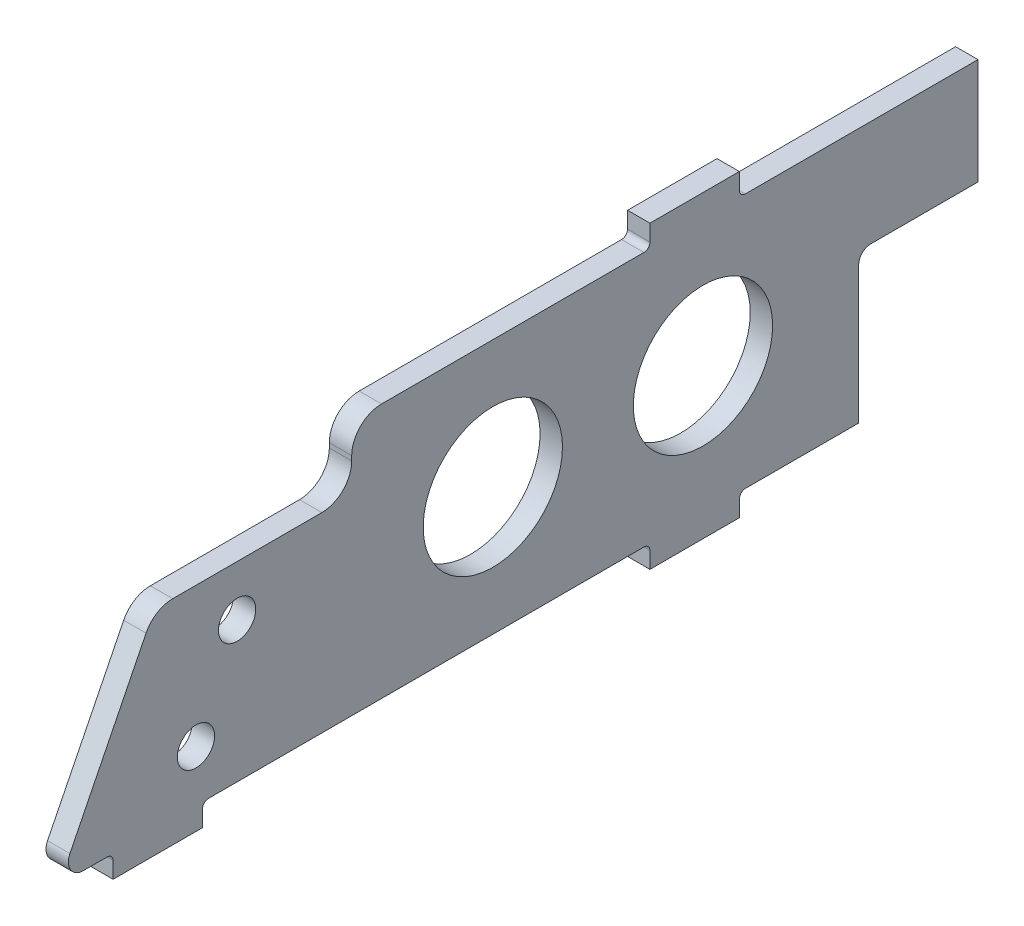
ISO-10303-21;
HEADER;
FILE_DESCRIPTION(('STEP AP214'),'2;1');
FILE_NAME('part.step','',(''),(''),'','','');
FILE_SCHEMA(('AUTOMOTIVE_DESIGN { 1 0 10303 214 1 1 1 1 }'));
ENDSEC;
DATA;
#1=APPLICATION_CONTEXT('core data for automotive mechanical design processes');
#2=APPLICATION_PROTOCOL_DEFINITION('international standard','automotive_design',2000,#1);
#3=PRODUCT_CONTEXT('',#1,'mechanical');
#4=PRODUCT('Part','Part','',(#3));
#5=PRODUCT_RELATED_PRODUCT_CATEGORY('part','',(#4));
#6=PRODUCT_DEFINITION_FORMATION('','',#4);
#7=PRODUCT_DEFINITION_CONTEXT('part definition',#1,'design');
#8=PRODUCT_DEFINITION('design','',#6,#7);
#9=PRODUCT_DEFINITION_SHAPE('','',#8);
#10=(LENGTH_UNIT() NAMED_UNIT(*) SI_UNIT(.MILLI.,.METRE.));
#11=(NAMED_UNIT(*) PLANE_ANGLE_UNIT() SI_UNIT($,.RADIAN.));
#12=(NAMED_UNIT(*) SI_UNIT($,.STERADIAN.) SOLID_ANGLE_UNIT());
#13=UNCERTAINTY_MEASURE_WITH_UNIT(LENGTH_MEASURE(1.E-05),#10,'distance_accuracy_value','');
#14=(GEOMETRIC_REPRESENTATION_CONTEXT(3) GLOBAL_UNCERTAINTY_ASSIGNED_CONTEXT((#13)) GLOBAL_UNIT_ASSIGNED_CONTEXT((#10,
#11,#12)) REPRESENTATION_CONTEXT('',''));
#15=CARTESIAN_POINT('',(0.,0.,0.));
#16=DIRECTION('',(0.,0.,1.));
#17=DIRECTION('',(1.,0.,0.));
#18=AXIS2_PLACEMENT_3D('',#15,#16,#17);
#19=CARTESIAN_POINT('',(-11.3665,237.813515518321,127.));
#20=DIRECTION('',(0.,-1.,0.));
#21=DIRECTION('',(1.,0.,0.));
#22=AXIS2_PLACEMENT_3D('',#19,#20,#21);
#23=PLANE('',#22);
#24=DIRECTION('',(0.,0.,-1.));
#25=VECTOR('',#24,1.);
#26=CARTESIAN_POINT('',(-6.60399999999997,237.813515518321,127.));
#27=LINE('',#26,#25);
#28=CARTESIAN_POINT('',(-6.60399999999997,237.813515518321,127.));
#29=VERTEX_POINT('',#28);
#30=CARTESIAN_POINT('',(-6.60399999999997,237.813515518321,71.12));
#31=VERTEX_POINT('',#30);
#32=EDGE_CURVE('E316',#29,#31,#27,.T.);
#33=ORIENTED_EDGE('',*,*,#32,.T.);
#34=DIRECTION('',(1.,0.,0.));
#35=VECTOR('',#34,1.);
#36=CARTESIAN_POINT('',(-11.3665,237.813515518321,71.12));
#37=LINE('',#36,#35);
#38=CARTESIAN_POINT('',(-11.3665,237.813515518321,71.12));
#39=VERTEX_POINT('',#38);
#40=EDGE_CURVE('E427',#31,#39,#37,.F.);
#41=ORIENTED_EDGE('',*,*,#40,.T.);
#42=DIRECTION('',(0.,0.,-1.));
#43=VECTOR('',#42,1.);
#44=CARTESIAN_POINT('',(-11.3665,237.813515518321,127.));
#45=LINE('',#44,#43);
#46=CARTESIAN_POINT('',(-11.3665,237.813515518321,127.));
#47=VERTEX_POINT('',#46);
#48=EDGE_CURVE('E334',#47,#39,#45,.T.);
#49=ORIENTED_EDGE('',*,*,#48,.F.);
#50=DIRECTION('',(1.,0.,0.));
#51=VECTOR('',#50,1.);
#52=CARTESIAN_POINT('',(-11.3665,237.813515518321,127.));
#53=LINE('',#52,#51);
#54=EDGE_CURVE('E361',#47,#29,#53,.T.);
#55=ORIENTED_EDGE('',*,*,#54,.T.);
#56=EDGE_LOOP('',(#33,#41,#49,#55));
#57=FACE_BOUND('',#56,.T.);
#58=ADVANCED_FACE('F32',(#57),#23,.F.);
#59=CARTESIAN_POINT('',(-11.3665,183.496598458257,345.417575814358));
#60=DIRECTION('',(0.,1.,0.));
#61=DIRECTION('',(0.,0.,1.));
#62=AXIS2_PLACEMENT_3D('',#59,#60,#61);
#63=PLANE('',#62);
#64=DIRECTION('',(0.,0.,-1.));
#65=VECTOR('',#64,1.);
#66=CARTESIAN_POINT('',(-11.3665,183.496598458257,345.417575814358));
#67=LINE('',#66,#65);
#68=CARTESIAN_POINT('',(-11.3665,183.496598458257,163.83));
#69=VERTEX_POINT('',#68);
#70=CARTESIAN_POINT('',(-11.3665,183.496598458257,71.12));
#71=VERTEX_POINT('',#70);
#72=EDGE_CURVE('E416',#69,#71,#67,.T.);
#73=ORIENTED_EDGE('',*,*,#72,.T.);
#74=DIRECTION('',(1.,0.,0.));
#75=VECTOR('',#74,1.);
#76=CARTESIAN_POINT('',(-11.3665,183.496598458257,71.12));
#77=LINE('',#76,#75);
#78=CARTESIAN_POINT('',(-6.60399999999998,183.496598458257,71.12));
#79=VERTEX_POINT('',#78);
#80=EDGE_CURVE('E431',#71,#79,#77,.T.);
#81=ORIENTED_EDGE('',*,*,#80,.T.);
#82=DIRECTION('',(0.,0.,-1.));
#83=VECTOR('',#82,1.);
#84=CARTESIAN_POINT('',(-6.60399999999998,183.496598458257,345.417575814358));
#85=LINE('',#84,#83);
#86=CARTESIAN_POINT('',(-6.60399999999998,183.496598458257,163.83));
#87=VERTEX_POINT('',#86);
#88=EDGE_CURVE('E420',#87,#79,#85,.T.);
#89=ORIENTED_EDGE('',*,*,#88,.F.);
#90=DIRECTION('',(1.,0.,0.));
#91=VECTOR('',#90,1.);
#92=CARTESIAN_POINT('',(-11.3665,183.496598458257,163.83));
#93=LINE('',#92,#91);
#94=EDGE_CURVE('E429',#87,#69,#93,.F.);
#95=ORIENTED_EDGE('',*,*,#94,.T.);
#96=EDGE_LOOP('',(#73,#81,#89,#95));
#97=FACE_BOUND('',#96,.T.);
#98=ADVANCED_FACE('F483',(#97),#63,.F.);
#99=CARTESIAN_POINT('',(-11.3665,183.496598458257,190.5));
#100=VERTEX_POINT('',#99);
#101=CARTESIAN_POINT('',(-11.3665,183.496598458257,185.42));
#102=VERTEX_POINT('',#101);
#103=EDGE_CURVE('E412',#100,#102,#67,.T.);
#104=ORIENTED_EDGE('',*,*,#103,.T.);
#105=DIRECTION('',(1.,0.,0.));
#106=VECTOR('',#105,1.);
#107=CARTESIAN_POINT('',(-11.3665,183.496598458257,185.42));
#108=LINE('',#107,#106);
#109=CARTESIAN_POINT('',(-6.60399999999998,183.496598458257,185.42));
#110=VERTEX_POINT('',#109);
#111=EDGE_CURVE('E444',#102,#110,#108,.T.);
#112=ORIENTED_EDGE('',*,*,#111,.T.);
#113=CARTESIAN_POINT('',(-6.60399999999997,183.496598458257,190.5));
#114=VERTEX_POINT('',#113);
#115=EDGE_CURVE('E417',#114,#110,#85,.T.);
#116=ORIENTED_EDGE('',*,*,#115,.F.);
#117=DIRECTION('',(1.,0.,0.));
#118=VECTOR('',#117,1.);
#119=CARTESIAN_POINT('',(-11.3665,183.496598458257,190.5));
#120=LINE('',#119,#118);
#121=EDGE_CURVE('E337',#100,#114,#120,.T.);
#122=ORIENTED_EDGE('',*,*,#121,.F.);
#123=EDGE_LOOP('',(#104,#112,#116,#122));
#124=FACE_BOUND('',#123,.T.);
#125=ADVANCED_FACE('F532',(#124),#63,.F.);
#126=CARTESIAN_POINT('',(-6.60399999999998,183.496598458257,0.));
#127=DIRECTION('',(0.,0.,1.));
#128=DIRECTION('',(1.,0.,0.));
#129=AXIS2_PLACEMENT_3D('',#126,#127,#128);
#130=PLANE('',#129);
#131=DIRECTION('',(0.,-1.,0.));
#132=VECTOR('',#131,1.);
#133=CARTESIAN_POINT('',(-11.3665,262.744598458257,0.));
#134=LINE('',#133,#132);
#135=CARTESIAN_POINT('',(-11.3665,237.813515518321,0.));
#136=VERTEX_POINT('',#135);
#137=CARTESIAN_POINT('',(-11.3665,215.246598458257,0.));
#138=VERTEX_POINT('',#137);
#139=EDGE_CURVE('E409',#136,#138,#134,.T.);
#140=ORIENTED_EDGE('',*,*,#139,.F.);
#141=DIRECTION('',(1.,0.,0.));
#142=VECTOR('',#141,1.);
#143=CARTESIAN_POINT('',(-6.60399999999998,237.813515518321,0.));
#144=LINE('',#143,#142);
#145=CARTESIAN_POINT('',(-6.60399999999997,237.813515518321,0.));
#146=VERTEX_POINT('',#145);
#147=EDGE_CURVE('E363',#136,#146,#144,.T.);
#148=ORIENTED_EDGE('',*,*,#147,.T.);
#149=DIRECTION('',(0.,1.,0.));
#150=VECTOR('',#149,1.);
#151=CARTESIAN_POINT('',(-6.60399999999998,183.496598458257,0.));
#152=LINE('',#151,#150);
#153=CARTESIAN_POINT('',(-6.60399999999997,215.246598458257,0.));
#154=VERTEX_POINT('',#153);
#155=EDGE_CURVE('E401',#154,#146,#152,.T.);
#156=ORIENTED_EDGE('',*,*,#155,.F.);
#157=DIRECTION('',(1.,0.,0.));
#158=VECTOR('',#157,1.);
#159=CARTESIAN_POINT('',(-11.3665,215.246598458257,0.));
#160=LINE('',#159,#158);
#161=EDGE_CURVE('E390',#138,#154,#160,.T.);
#162=ORIENTED_EDGE('',*,*,#161,.F.);
#163=EDGE_LOOP('',(#140,#148,#156,#162));
#164=FACE_BOUND('',#163,.T.);
#165=ADVANCED_FACE('F559',(#164),#130,.F.);
#166=CARTESIAN_POINT('',(-11.3665,262.744598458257,345.417575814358));
#167=DIRECTION('',(1.,0.,0.));
#168=DIRECTION('',(0.,1.,0.));
#169=AXIS2_PLACEMENT_3D('',#166,#167,#168);
#170=PLANE('',#169);
#171=CARTESIAN_POINT('',(-11.3665,210.655056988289,58.5588934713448));
#172=DIRECTION('',(1.,0.,0.));
#173=DIRECTION('',(0.,0.,-1.));
#174=AXIS2_PLACEMENT_3D('',#171,#172,#173);
#175=CIRCLE('',#174,14.8276468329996);
#176=CARTESIAN_POINT('',(-11.3665,210.655056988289,43.7312466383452));
#177=VERTEX_POINT('',#176);
#178=EDGE_CURVE('E611',#177,#177,#175,.T.);
#179=ORIENTED_EDGE('',*,*,#178,.T.);
#180=EDGE_LOOP('',(#179));
#181=FACE_BOUND('',#180,.T.);
#182=CARTESIAN_POINT('',(-11.3665,210.655056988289,103.299900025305));
#183=DIRECTION('',(1.,0.,0.));
#184=DIRECTION('',(0.,0.,-1.));
#185=AXIS2_PLACEMENT_3D('',#182,#183,#184);
#186=CIRCLE('',#185,14.8276468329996);
#187=CARTESIAN_POINT('',(-11.3665,210.655056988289,88.4722531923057));
#188=VERTEX_POINT('',#187);
#189=EDGE_CURVE('E607',#188,#188,#186,.T.);
#190=ORIENTED_EDGE('',*,*,#189,.T.);
#191=EDGE_LOOP('',(#190));
#192=FACE_BOUND('',#191,.T.);
#193=CARTESIAN_POINT('',(-11.3665,213.392398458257,157.747086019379));
#194=DIRECTION('',(1.,0.,0.));
#195=DIRECTION('',(0.,0.,-1.));
#196=AXIS2_PLACEMENT_3D('',#193,#194,#195);
#197=CIRCLE('',#196,3.96874999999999);
#198=CARTESIAN_POINT('',(-11.3665,213.392398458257,153.778336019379));
#199=VERTEX_POINT('',#198);
#200=EDGE_CURVE('E604',#199,#199,#197,.T.);
#201=ORIENTED_EDGE('',*,*,#200,.T.);
#202=EDGE_LOOP('',(#201));
#203=FACE_BOUND('',#202,.T.);
#204=CARTESIAN_POINT('',(-11.3665,194.418598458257,166.510086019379));
#205=DIRECTION('',(1.,0.,0.));
#206=DIRECTION('',(0.,0.,-1.));
#207=AXIS2_PLACEMENT_3D('',#204,#205,#206);
#208=CIRCLE('',#207,3.96874999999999);
#209=CARTESIAN_POINT('',(-11.3665,194.418598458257,162.541336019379));
#210=VERTEX_POINT('',#209);
#211=EDGE_CURVE('E598',#210,#210,#208,.T.);
#212=ORIENTED_EDGE('',*,*,#211,.T.);
#213=EDGE_LOOP('',(#212));
#214=FACE_BOUND('',#213,.T.);
#215=CARTESIAN_POINT('',(-11.3665,231.463515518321,127.));
#216=DIRECTION('',(-1.,0.,0.));
#217=DIRECTION('',(0.,1.,0.));
#218=AXIS2_PLACEMENT_3D('',#215,#216,#217);
#219=CIRCLE('',#218,6.34999999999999);
#220=CARTESIAN_POINT('',(-11.3665,231.463515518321,133.35));
#221=VERTEX_POINT('',#220);
#222=EDGE_CURVE('E331',#221,#47,#219,.T.);
#223=ORIENTED_EDGE('',*,*,#222,.T.);
#224=ORIENTED_EDGE('',*,*,#48,.T.);
#225=CARTESIAN_POINT('',(-11.3665,239.083515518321,71.12));
#226=DIRECTION('',(1.,0.,0.));
#227=DIRECTION('',(0.,1.,0.));
#228=AXIS2_PLACEMENT_3D('',#225,#226,#227);
#229=CIRCLE('',#228,1.27);
#230=CARTESIAN_POINT('',(-11.3665,239.083515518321,69.85));
#231=VERTEX_POINT('',#230);
#232=EDGE_CURVE('E454',#39,#231,#229,.T.);
#233=ORIENTED_EDGE('',*,*,#232,.T.);
#234=DIRECTION('',(0.,-1.,0.));
#235=VECTOR('',#234,1.);
#236=CARTESIAN_POINT('',(-11.3665,242.576015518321,69.85));
#237=LINE('',#236,#235);
#238=CARTESIAN_POINT('',(-11.3665,242.576015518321,69.85));
#239=VERTEX_POINT('',#238);
#240=EDGE_CURVE('E245',#239,#231,#237,.T.);
#241=ORIENTED_EDGE('',*,*,#240,.F.);
#242=DIRECTION('',(0.,0.,1.));
#243=VECTOR('',#242,1.);
#244=CARTESIAN_POINT('',(-11.3665,242.576015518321,69.85));
#245=LINE('',#244,#243);
#246=CARTESIAN_POINT('',(-11.3665,242.576015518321,50.8));
#247=VERTEX_POINT('',#246);
#248=EDGE_CURVE('E244',#247,#239,#245,.T.);
#249=ORIENTED_EDGE('',*,*,#248,.F.);
#250=DIRECTION('',(0.,1.,0.));
#251=VECTOR('',#250,1.);
#252=CARTESIAN_POINT('',(-11.3665,242.576015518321,50.8));
#253=LINE('',#252,#251);
#254=CARTESIAN_POINT('',(-11.3665,239.083515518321,50.8));
#255=VERTEX_POINT('',#254);
#256=EDGE_CURVE('E233',#255,#247,#253,.T.);
#257=ORIENTED_EDGE('',*,*,#256,.F.);
#258=CARTESIAN_POINT('',(-11.3665,239.083515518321,49.53));
#259=DIRECTION('',(1.,0.,0.));
#260=DIRECTION('',(0.,1.,0.));
#261=AXIS2_PLACEMENT_3D('',#258,#259,#260);
#262=CIRCLE('',#261,1.27);
#263=CARTESIAN_POINT('',(-11.3665,237.813515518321,49.53));
#264=VERTEX_POINT('',#263);
#265=EDGE_CURVE('E450',#255,#264,#262,.T.);
#266=ORIENTED_EDGE('',*,*,#265,.T.);
#267=EDGE_CURVE('E333',#264,#136,#45,.T.);
#268=ORIENTED_EDGE('',*,*,#267,.T.);
#269=ORIENTED_EDGE('',*,*,#139,.T.);
#270=DIRECTION('',(0.,0.,1.));
#271=VECTOR('',#270,1.);
#272=CARTESIAN_POINT('',(-11.3665,215.246598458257,0.));
#273=LINE('',#272,#271);
#274=CARTESIAN_POINT('',(-11.3665,215.246598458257,22.86));
#275=VERTEX_POINT('',#274);
#276=EDGE_CURVE('E380',#138,#275,#273,.T.);
#277=ORIENTED_EDGE('',*,*,#276,.T.);
#278=CARTESIAN_POINT('',(-11.3665,212.706598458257,22.86));
#279=DIRECTION('',(1.,0.,0.));
#280=DIRECTION('',(0.,-1.,0.));
#281=AXIS2_PLACEMENT_3D('',#278,#279,#280);
#282=CIRCLE('',#281,2.53999999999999);
#283=CARTESIAN_POINT('',(-11.3665,212.706598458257,25.4));
#284=VERTEX_POINT('',#283);
#285=EDGE_CURVE('E383',#275,#284,#282,.T.);
#286=ORIENTED_EDGE('',*,*,#285,.T.);
#287=DIRECTION('',(0.,-1.,0.));
#288=VECTOR('',#287,1.);
#289=CARTESIAN_POINT('',(-11.3665,212.706598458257,25.4));
#290=LINE('',#289,#288);
#291=CARTESIAN_POINT('',(-11.3665,183.496598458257,25.4));
#292=VERTEX_POINT('',#291);
#293=EDGE_CURVE('E387',#284,#292,#290,.T.);
#294=ORIENTED_EDGE('',*,*,#293,.T.);
#295=CARTESIAN_POINT('',(-11.3665,183.496598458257,49.53));
#296=VERTEX_POINT('',#295);
#297=EDGE_CURVE('E411',#296,#292,#67,.T.);
#298=ORIENTED_EDGE('',*,*,#297,.F.);
#299=CARTESIAN_POINT('',(-11.3665,182.226598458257,49.53));
#300=DIRECTION('',(1.,0.,0.));
#301=DIRECTION('',(0.,1.,0.));
#302=AXIS2_PLACEMENT_3D('',#299,#300,#301);
#303=CIRCLE('',#302,1.27);
#304=CARTESIAN_POINT('',(-11.3665,182.226598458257,50.8));
#305=VERTEX_POINT('',#304);
#306=EDGE_CURVE('E462',#296,#305,#303,.T.);
#307=ORIENTED_EDGE('',*,*,#306,.T.);
#308=DIRECTION('',(0.,1.,0.));
#309=VECTOR('',#308,1.);
#310=CARTESIAN_POINT('',(-11.3665,183.496598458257,50.8));
#311=LINE('',#310,#309);
#312=CARTESIAN_POINT('',(-11.3665,178.734098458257,50.8));
#313=VERTEX_POINT('',#312);
#314=EDGE_CURVE('E297',#313,#305,#311,.T.);
#315=ORIENTED_EDGE('',*,*,#314,.F.);
#316=DIRECTION('',(0.,0.,-1.));
#317=VECTOR('',#316,1.);
#318=CARTESIAN_POINT('',(-11.3665,178.734098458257,69.85));
#319=LINE('',#318,#317);
#320=CARTESIAN_POINT('',(-11.3665,178.734098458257,69.85));
#321=VERTEX_POINT('',#320);
#322=EDGE_CURVE('E293',#321,#313,#319,.T.);
#323=ORIENTED_EDGE('',*,*,#322,.F.);
#324=DIRECTION('',(0.,-1.,0.));
#325=VECTOR('',#324,1.);
#326=CARTESIAN_POINT('',(-11.3665,183.496598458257,69.85));
#327=LINE('',#326,#325);
#328=CARTESIAN_POINT('',(-11.3665,182.226598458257,69.85));
#329=VERTEX_POINT('',#328);
#330=EDGE_CURVE('E291',#329,#321,#327,.T.);
#331=ORIENTED_EDGE('',*,*,#330,.F.);
#332=CARTESIAN_POINT('',(-11.3665,182.226598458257,71.12));
#333=DIRECTION('',(1.,0.,0.));
#334=DIRECTION('',(0.,1.,0.));
#335=AXIS2_PLACEMENT_3D('',#332,#333,#334);
#336=CIRCLE('',#335,1.27);
#337=EDGE_CURVE('E458',#329,#71,#336,.T.);
#338=ORIENTED_EDGE('',*,*,#337,.T.);
#339=ORIENTED_EDGE('',*,*,#72,.F.);
#340=CARTESIAN_POINT('',(-11.3665,182.226598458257,163.83));
#341=DIRECTION('',(1.,0.,0.));
#342=DIRECTION('',(0.,1.,0.));
#343=AXIS2_PLACEMENT_3D('',#340,#341,#342);
#344=CIRCLE('',#343,1.27);
#345=CARTESIAN_POINT('',(-11.3665,182.226598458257,165.1));
#346=VERTEX_POINT('',#345);
#347=EDGE_CURVE('E466',#69,#346,#344,.T.);
#348=ORIENTED_EDGE('',*,*,#347,.T.);
#349=DIRECTION('',(0.,1.,0.));
#350=VECTOR('',#349,1.);
#351=CARTESIAN_POINT('',(-11.3665,183.496598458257,165.1));
#352=LINE('',#351,#350);
#353=CARTESIAN_POINT('',(-11.3665,178.734098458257,165.1));
#354=VERTEX_POINT('',#353);
#355=EDGE_CURVE('E270',#354,#346,#352,.T.);
#356=ORIENTED_EDGE('',*,*,#355,.F.);
#357=DIRECTION('',(0.,0.,-1.));
#358=VECTOR('',#357,1.);
#359=CARTESIAN_POINT('',(-11.3665,178.734098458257,165.1));
#360=LINE('',#359,#358);
#361=CARTESIAN_POINT('',(-11.3665,178.734098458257,184.15));
#362=VERTEX_POINT('',#361);
#363=EDGE_CURVE('E276',#362,#354,#360,.T.);
#364=ORIENTED_EDGE('',*,*,#363,.F.);
#365=DIRECTION('',(0.,-1.,0.));
#366=VECTOR('',#365,1.);
#367=CARTESIAN_POINT('',(-11.3665,183.496598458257,184.15));
#368=LINE('',#367,#366);
#369=CARTESIAN_POINT('',(-11.3665,182.226598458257,184.15));
#370=VERTEX_POINT('',#369);
#371=EDGE_CURVE('E273',#370,#362,#368,.T.);
#372=ORIENTED_EDGE('',*,*,#371,.F.);
#373=CARTESIAN_POINT('',(-11.3665,182.226598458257,185.42));
#374=DIRECTION('',(1.,0.,0.));
#375=DIRECTION('',(0.,1.,0.));
#376=AXIS2_PLACEMENT_3D('',#373,#374,#375);
#377=CIRCLE('',#376,1.27);
#378=EDGE_CURVE('E11',#370,#102,#377,.T.);
#379=ORIENTED_EDGE('',*,*,#378,.T.);
#380=ORIENTED_EDGE('',*,*,#103,.F.);
#381=CARTESIAN_POINT('',(-11.3665,186.671598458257,190.5));
#382=DIRECTION('',(-1.,0.,0.));
#383=DIRECTION('',(0.,1.,0.));
#384=AXIS2_PLACEMENT_3D('',#381,#382,#383);
#385=CIRCLE('',#384,3.17499999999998);
#386=CARTESIAN_POINT('',(-11.3665,188.087498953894,193.341804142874));
#387=VERTEX_POINT('',#386);
#388=EDGE_CURVE('E312',#100,#387,#385,.T.);
#389=ORIENTED_EDGE('',*,*,#388,.T.);
#390=DIRECTION('',(0.,0.895056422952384,-0.445952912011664));
#391=VECTOR('',#390,1.);
#392=CARTESIAN_POINT('',(-11.3665,220.618399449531,177.133608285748));
#393=LINE('',#392,#391);
#394=CARTESIAN_POINT('',(-11.3665,220.618399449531,177.133608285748));
#395=VERTEX_POINT('',#394);
#396=EDGE_CURVE('E315',#387,#395,#393,.T.);
#397=ORIENTED_EDGE('',*,*,#396,.T.);
#398=CARTESIAN_POINT('',(-11.3665,217.786598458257,171.45));
#399=DIRECTION('',(-1.,0.,0.));
#400=DIRECTION('',(0.,1.,0.));
#401=AXIS2_PLACEMENT_3D('',#398,#399,#400);
#402=CIRCLE('',#401,6.34999999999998);
#403=CARTESIAN_POINT('',(-11.3665,224.136598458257,171.45));
#404=VERTEX_POINT('',#403);
#405=EDGE_CURVE('E319',#395,#404,#402,.T.);
#406=ORIENTED_EDGE('',*,*,#405,.T.);
#407=DIRECTION('',(0.,0.,-1.));
#408=VECTOR('',#407,1.);
#409=CARTESIAN_POINT('',(-11.3665,224.136598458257,171.45));
#410=LINE('',#409,#408);
#411=CARTESIAN_POINT('',(-11.3665,224.136598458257,139.7));
#412=VERTEX_POINT('',#411);
#413=EDGE_CURVE('E322',#404,#412,#410,.T.);
#414=ORIENTED_EDGE('',*,*,#413,.T.);
#415=CARTESIAN_POINT('',(-11.3665,230.486598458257,139.7));
#416=DIRECTION('',(1.,0.,0.));
#417=DIRECTION('',(0.,-1.,0.));
#418=AXIS2_PLACEMENT_3D('',#415,#416,#417);
#419=CIRCLE('',#418,6.34999999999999);
#420=CARTESIAN_POINT('',(-11.3665,230.486598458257,133.35));
#421=VERTEX_POINT('',#420);
#422=EDGE_CURVE('E325',#412,#421,#419,.T.);
#423=ORIENTED_EDGE('',*,*,#422,.T.);
#424=DIRECTION('',(0.,1.,0.));
#425=VECTOR('',#424,1.);
#426=CARTESIAN_POINT('',(-11.3665,230.486598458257,133.35));
#427=LINE('',#426,#425);
#428=EDGE_CURVE('E328',#421,#221,#427,.T.);
#429=ORIENTED_EDGE('',*,*,#428,.T.);
#430=EDGE_LOOP('',(#223,#224,#233,#241,#249,#257,#266,#268,#269,#277,#286,#294,#298,#307,#315,
#323,#331,#338,#339,#348,#356,#364,#372,#379,#380,#389,#397,#406,#414,#423,#429));
#431=FACE_BOUND('',#430,.T.);
#432=ADVANCED_FACE('F256',(#181,#192,#203,#214,#431),#170,.F.);
#433=CARTESIAN_POINT('',(-6.60399999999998,183.496598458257,345.417575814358));
#434=DIRECTION('',(-1.,0.,0.));
#435=DIRECTION('',(0.,0.,1.));
#436=AXIS2_PLACEMENT_3D('',#433,#434,#435);
#437=PLANE('',#436);
#438=CARTESIAN_POINT('',(-6.60399999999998,210.655056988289,58.5588934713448));
#439=DIRECTION('',(1.,0.,0.));
#440=DIRECTION('',(0.,0.,-1.));
#441=AXIS2_PLACEMENT_3D('',#438,#439,#440);
#442=CIRCLE('',#441,14.8276468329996);
#443=CARTESIAN_POINT('',(-6.60399999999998,210.655056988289,43.7312466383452));
#444=VERTEX_POINT('',#443);
#445=EDGE_CURVE('E614',#444,#444,#442,.T.);
#446=ORIENTED_EDGE('',*,*,#445,.F.);
#447=EDGE_LOOP('',(#446));
#448=FACE_BOUND('',#447,.T.);
#449=CARTESIAN_POINT('',(-6.60399999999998,210.655056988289,103.299900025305));
#450=DIRECTION('',(1.,0.,0.));
#451=DIRECTION('',(0.,0.,-1.));
#452=AXIS2_PLACEMENT_3D('',#449,#450,#451);
#453=CIRCLE('',#452,14.8276468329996);
#454=CARTESIAN_POINT('',(-6.60399999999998,210.655056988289,88.4722531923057));
#455=VERTEX_POINT('',#454);
#456=EDGE_CURVE('E608',#455,#455,#453,.T.);
#457=ORIENTED_EDGE('',*,*,#456,.F.);
#458=EDGE_LOOP('',(#457));
#459=FACE_BOUND('',#458,.T.);
#460=CARTESIAN_POINT('',(-6.60399999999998,213.392398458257,157.747086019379));
#461=DIRECTION('',(1.,0.,0.));
#462=DIRECTION('',(0.,0.,-1.));
#463=AXIS2_PLACEMENT_3D('',#460,#461,#462);
#464=CIRCLE('',#463,3.96874999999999);
#465=CARTESIAN_POINT('',(-6.60399999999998,213.392398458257,153.778336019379));
#466=VERTEX_POINT('',#465);
#467=EDGE_CURVE('E601',#466,#466,#464,.T.);
#468=ORIENTED_EDGE('',*,*,#467,.F.);
#469=EDGE_LOOP('',(#468));
#470=FACE_BOUND('',#469,.T.);
#471=CARTESIAN_POINT('',(-6.60399999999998,194.418598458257,166.510086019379));
#472=DIRECTION('',(1.,0.,0.));
#473=DIRECTION('',(0.,0.,-1.));
#474=AXIS2_PLACEMENT_3D('',#471,#472,#473);
#475=CIRCLE('',#474,3.96874999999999);
#476=CARTESIAN_POINT('',(-6.60399999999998,194.418598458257,162.541336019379));
#477=VERTEX_POINT('',#476);
#478=EDGE_CURVE('E265',#477,#477,#475,.T.);
#479=ORIENTED_EDGE('',*,*,#478,.F.);
#480=EDGE_LOOP('',(#479));
#481=FACE_BOUND('',#480,.T.);
#482=ORIENTED_EDGE('',*,*,#155,.T.);
#483=CARTESIAN_POINT('',(-6.60399999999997,237.813515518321,49.53));
#484=VERTEX_POINT('',#483);
#485=EDGE_CURVE('E358',#484,#146,#27,.T.);
#486=ORIENTED_EDGE('',*,*,#485,.F.);
#487=CARTESIAN_POINT('',(-6.60399999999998,239.083515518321,49.53));
#488=DIRECTION('',(-1.,0.,0.));
#489=DIRECTION('',(0.,0.,1.));
#490=AXIS2_PLACEMENT_3D('',#487,#488,#489);
#491=CIRCLE('',#490,1.27);
#492=CARTESIAN_POINT('',(-6.60399999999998,239.083515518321,50.8));
#493=VERTEX_POINT('',#492);
#494=EDGE_CURVE('E448',#484,#493,#491,.T.);
#495=ORIENTED_EDGE('',*,*,#494,.T.);
#496=DIRECTION('',(0.,1.,0.));
#497=VECTOR('',#496,1.);
#498=CARTESIAN_POINT('',(-6.60399999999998,242.576015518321,50.8));
#499=LINE('',#498,#497);
#500=CARTESIAN_POINT('',(-6.60399999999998,242.576015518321,50.8));
#501=VERTEX_POINT('',#500);
#502=EDGE_CURVE('E264',#493,#501,#499,.T.);
#503=ORIENTED_EDGE('',*,*,#502,.T.);
#504=DIRECTION('',(0.,0.,1.));
#505=VECTOR('',#504,1.);
#506=CARTESIAN_POINT('',(-6.60399999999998,242.576015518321,69.85));
#507=LINE('',#506,#505);
#508=CARTESIAN_POINT('',(-6.60399999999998,242.576015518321,69.85));
#509=VERTEX_POINT('',#508);
#510=EDGE_CURVE('E251',#501,#509,#507,.T.);
#511=ORIENTED_EDGE('',*,*,#510,.T.);
#512=DIRECTION('',(0.,-1.,0.));
#513=VECTOR('',#512,1.);
#514=CARTESIAN_POINT('',(-6.60399999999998,242.576015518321,69.85));
#515=LINE('',#514,#513);
#516=CARTESIAN_POINT('',(-6.60399999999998,239.083515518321,69.85));
#517=VERTEX_POINT('',#516);
#518=EDGE_CURVE('E261',#509,#517,#515,.T.);
#519=ORIENTED_EDGE('',*,*,#518,.T.);
#520=CARTESIAN_POINT('',(-6.60399999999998,239.083515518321,71.12));
#521=DIRECTION('',(-1.,0.,0.));
#522=DIRECTION('',(0.,0.,1.));
#523=AXIS2_PLACEMENT_3D('',#520,#521,#522);
#524=CIRCLE('',#523,1.27);
#525=EDGE_CURVE('E452',#517,#31,#524,.T.);
#526=ORIENTED_EDGE('',*,*,#525,.T.);
#527=ORIENTED_EDGE('',*,*,#32,.F.);
#528=CARTESIAN_POINT('',(-6.60399999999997,231.463515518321,127.));
#529=DIRECTION('',(-1.,0.,0.));
#530=DIRECTION('',(0.,1.,0.));
#531=AXIS2_PLACEMENT_3D('',#528,#529,#530);
#532=CIRCLE('',#531,6.34999999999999);
#533=CARTESIAN_POINT('',(-6.60399999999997,231.463515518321,133.35));
#534=VERTEX_POINT('',#533);
#535=EDGE_CURVE('E355',#534,#29,#532,.T.);
#536=ORIENTED_EDGE('',*,*,#535,.F.);
#537=DIRECTION('',(0.,1.,0.));
#538=VECTOR('',#537,1.);
#539=CARTESIAN_POINT('',(-6.60399999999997,230.486598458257,133.35));
#540=LINE('',#539,#538);
#541=CARTESIAN_POINT('',(-6.60399999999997,230.486598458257,133.35));
#542=VERTEX_POINT('',#541);
#543=EDGE_CURVE('E352',#542,#534,#540,.T.);
#544=ORIENTED_EDGE('',*,*,#543,.F.);
#545=CARTESIAN_POINT('',(-6.60399999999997,230.486598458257,139.7));
#546=DIRECTION('',(1.,0.,0.));
#547=DIRECTION('',(0.,-1.,0.));
#548=AXIS2_PLACEMENT_3D('',#545,#546,#547);
#549=CIRCLE('',#548,6.34999999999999);
#550=CARTESIAN_POINT('',(-6.60399999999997,224.136598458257,139.7));
#551=VERTEX_POINT('',#550);
#552=EDGE_CURVE('E349',#551,#542,#549,.T.);
#553=ORIENTED_EDGE('',*,*,#552,.F.);
#554=DIRECTION('',(0.,0.,-1.));
#555=VECTOR('',#554,1.);
#556=CARTESIAN_POINT('',(-6.60399999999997,224.136598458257,171.45));
#557=LINE('',#556,#555);
#558=CARTESIAN_POINT('',(-6.60399999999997,224.136598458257,171.45));
#559=VERTEX_POINT('',#558);
#560=EDGE_CURVE('E346',#559,#551,#557,.T.);
#561=ORIENTED_EDGE('',*,*,#560,.F.);
#562=CARTESIAN_POINT('',(-6.60399999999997,217.786598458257,171.45));
#563=DIRECTION('',(-1.,0.,0.));
#564=DIRECTION('',(0.,1.,0.));
#565=AXIS2_PLACEMENT_3D('',#562,#563,#564);
#566=CIRCLE('',#565,6.34999999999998);
#567=CARTESIAN_POINT('',(-6.60399999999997,220.618399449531,177.133608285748));
#568=VERTEX_POINT('',#567);
#569=EDGE_CURVE('E343',#568,#559,#566,.T.);
#570=ORIENTED_EDGE('',*,*,#569,.F.);
#571=DIRECTION('',(0.,0.895056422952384,-0.445952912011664));
#572=VECTOR('',#571,1.);
#573=CARTESIAN_POINT('',(-6.60399999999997,220.618399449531,177.133608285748));
#574=LINE('',#573,#572);
#575=CARTESIAN_POINT('',(-6.60399999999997,188.087498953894,193.341804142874));
#576=VERTEX_POINT('',#575);
#577=EDGE_CURVE('E340',#576,#568,#574,.T.);
#578=ORIENTED_EDGE('',*,*,#577,.F.);
#579=CARTESIAN_POINT('',(-6.60399999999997,186.671598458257,190.5));
#580=DIRECTION('',(-1.,0.,0.));
#581=DIRECTION('',(0.,1.,0.));
#582=AXIS2_PLACEMENT_3D('',#579,#580,#581);
#583=CIRCLE('',#582,3.17499999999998);
#584=EDGE_CURVE('E309',#114,#576,#583,.T.);
#585=ORIENTED_EDGE('',*,*,#584,.F.);
#586=ORIENTED_EDGE('',*,*,#115,.T.);
#587=CARTESIAN_POINT('',(-6.60399999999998,182.226598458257,185.42));
#588=DIRECTION('',(-1.,0.,0.));
#589=DIRECTION('',(0.,0.,1.));
#590=AXIS2_PLACEMENT_3D('',#587,#588,#589);
#591=CIRCLE('',#590,1.27);
#592=CARTESIAN_POINT('',(-6.60399999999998,182.226598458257,184.15));
#593=VERTEX_POINT('',#592);
#594=EDGE_CURVE('E40',#110,#593,#591,.T.);
#595=ORIENTED_EDGE('',*,*,#594,.T.);
#596=DIRECTION('',(0.,-1.,0.));
#597=VECTOR('',#596,1.);
#598=CARTESIAN_POINT('',(-6.60399999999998,183.496598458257,184.15));
#599=LINE('',#598,#597);
#600=CARTESIAN_POINT('',(-6.60399999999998,178.734098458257,184.15));
#601=VERTEX_POINT('',#600);
#602=EDGE_CURVE('E282',#593,#601,#599,.T.);
#603=ORIENTED_EDGE('',*,*,#602,.T.);
#604=DIRECTION('',(0.,0.,-1.));
#605=VECTOR('',#604,1.);
#606=CARTESIAN_POINT('',(-6.60399999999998,178.734098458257,165.1));
#607=LINE('',#606,#605);
#608=CARTESIAN_POINT('',(-6.60399999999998,178.734098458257,165.1));
#609=VERTEX_POINT('',#608);
#610=EDGE_CURVE('E274',#601,#609,#607,.T.);
#611=ORIENTED_EDGE('',*,*,#610,.T.);
#612=DIRECTION('',(0.,1.,0.));
#613=VECTOR('',#612,1.);
#614=CARTESIAN_POINT('',(-6.60399999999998,183.496598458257,165.1));
#615=LINE('',#614,#613);
#616=CARTESIAN_POINT('',(-6.60399999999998,182.226598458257,165.1));
#617=VERTEX_POINT('',#616);
#618=EDGE_CURVE('E268',#609,#617,#615,.T.);
#619=ORIENTED_EDGE('',*,*,#618,.T.);
#620=CARTESIAN_POINT('',(-6.60399999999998,182.226598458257,163.83));
#621=DIRECTION('',(-1.,0.,0.));
#622=DIRECTION('',(0.,0.,1.));
#623=AXIS2_PLACEMENT_3D('',#620,#621,#622);
#624=CIRCLE('',#623,1.27);
#625=EDGE_CURVE('E464',#617,#87,#624,.T.);
#626=ORIENTED_EDGE('',*,*,#625,.T.);
#627=ORIENTED_EDGE('',*,*,#88,.T.);
#628=CARTESIAN_POINT('',(-6.60399999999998,182.226598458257,71.12));
#629=DIRECTION('',(-1.,0.,0.));
#630=DIRECTION('',(0.,0.,1.));
#631=AXIS2_PLACEMENT_3D('',#628,#629,#630);
#632=CIRCLE('',#631,1.27);
#633=CARTESIAN_POINT('',(-6.60399999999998,182.226598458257,69.85));
#634=VERTEX_POINT('',#633);
#635=EDGE_CURVE('E456',#79,#634,#632,.T.);
#636=ORIENTED_EDGE('',*,*,#635,.T.);
#637=DIRECTION('',(0.,-1.,0.));
#638=VECTOR('',#637,1.);
#639=CARTESIAN_POINT('',(-6.60399999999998,183.496598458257,69.85));
#640=LINE('',#639,#638);
#641=CARTESIAN_POINT('',(-6.60399999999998,178.734098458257,69.85));
#642=VERTEX_POINT('',#641);
#643=EDGE_CURVE('E288',#634,#642,#640,.T.);
#644=ORIENTED_EDGE('',*,*,#643,.T.);
#645=DIRECTION('',(0.,0.,-1.));
#646=VECTOR('',#645,1.);
#647=CARTESIAN_POINT('',(-6.60399999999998,178.734098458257,69.85));
#648=LINE('',#647,#646);
#649=CARTESIAN_POINT('',(-6.60399999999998,178.734098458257,50.8));
#650=VERTEX_POINT('',#649);
#651=EDGE_CURVE('E302',#642,#650,#648,.T.);
#652=ORIENTED_EDGE('',*,*,#651,.T.);
#653=DIRECTION('',(0.,1.,0.));
#654=VECTOR('',#653,1.);
#655=CARTESIAN_POINT('',(-6.60399999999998,183.496598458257,50.8));
#656=LINE('',#655,#654);
#657=CARTESIAN_POINT('',(-6.60399999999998,182.226598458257,50.8));
#658=VERTEX_POINT('',#657);
#659=EDGE_CURVE('E294',#650,#658,#656,.T.);
#660=ORIENTED_EDGE('',*,*,#659,.T.);
#661=CARTESIAN_POINT('',(-6.60399999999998,182.226598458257,49.53));
#662=DIRECTION('',(-1.,0.,0.));
#663=DIRECTION('',(0.,0.,1.));
#664=AXIS2_PLACEMENT_3D('',#661,#662,#663);
#665=CIRCLE('',#664,1.27);
#666=CARTESIAN_POINT('',(-6.60399999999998,183.496598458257,49.53));
#667=VERTEX_POINT('',#666);
#668=EDGE_CURVE('E460',#658,#667,#665,.T.);
#669=ORIENTED_EDGE('',*,*,#668,.T.);
#670=CARTESIAN_POINT('',(-6.60399999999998,183.496598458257,25.4));
#671=VERTEX_POINT('',#670);
#672=EDGE_CURVE('E415',#667,#671,#85,.T.);
#673=ORIENTED_EDGE('',*,*,#672,.T.);
#674=DIRECTION('',(0.,-1.,0.));
#675=VECTOR('',#674,1.);
#676=CARTESIAN_POINT('',(-6.60399999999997,212.706598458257,25.4));
#677=LINE('',#676,#675);
#678=CARTESIAN_POINT('',(-6.60399999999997,212.706598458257,25.4));
#679=VERTEX_POINT('',#678);
#680=EDGE_CURVE('E384',#679,#671,#677,.T.);
#681=ORIENTED_EDGE('',*,*,#680,.F.);
#682=CARTESIAN_POINT('',(-6.60399999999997,212.706598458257,22.86));
#683=DIRECTION('',(1.,0.,0.));
#684=DIRECTION('',(0.,-1.,0.));
#685=AXIS2_PLACEMENT_3D('',#682,#683,#684);
#686=CIRCLE('',#685,2.53999999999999);
#687=CARTESIAN_POINT('',(-6.60399999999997,215.246598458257,22.86));
#688=VERTEX_POINT('',#687);
#689=EDGE_CURVE('E393',#688,#679,#686,.T.);
#690=ORIENTED_EDGE('',*,*,#689,.F.);
#691=DIRECTION('',(0.,0.,1.));
#692=VECTOR('',#691,1.);
#693=CARTESIAN_POINT('',(-6.60399999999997,215.246598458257,0.));
#694=LINE('',#693,#692);
#695=EDGE_CURVE('E379',#154,#688,#694,.T.);
#696=ORIENTED_EDGE('',*,*,#695,.F.);
#697=EDGE_LOOP('',(#482,#486,#495,#503,#511,#519,#526,#527,#536,#544,#553,#561,#570,#578,#585,
#586,#595,#603,#611,#619,#626,#627,#636,#644,#652,#660,#669,#673,#681,#690,#696));
#698=FACE_BOUND('',#697,.T.);
#699=ADVANCED_FACE('F481',(#448,#459,#470,#481,#698),#437,.F.);
#700=ORIENTED_EDGE('',*,*,#672,.F.);
#701=DIRECTION('',(1.,0.,0.));
#702=VECTOR('',#701,1.);
#703=CARTESIAN_POINT('',(-11.3665,183.496598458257,49.53));
#704=LINE('',#703,#702);
#705=EDGE_CURVE('E439',#667,#296,#704,.F.);
#706=ORIENTED_EDGE('',*,*,#705,.T.);
#707=ORIENTED_EDGE('',*,*,#297,.T.);
#708=DIRECTION('',(1.,0.,0.));
#709=VECTOR('',#708,1.);
#710=CARTESIAN_POINT('',(-11.3665,183.496598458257,25.4));
#711=LINE('',#710,#709);
#712=EDGE_CURVE('E398',#292,#671,#711,.T.);
#713=ORIENTED_EDGE('',*,*,#712,.T.);
#714=EDGE_LOOP('',(#700,#706,#707,#713));
#715=FACE_BOUND('',#714,.T.);
#716=ADVANCED_FACE('F494',(#715),#63,.F.);
#717=CARTESIAN_POINT('',(-11.3665,212.706598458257,25.4));
#718=DIRECTION('',(0.,0.,1.));
#719=DIRECTION('',(1.,0.,0.));
#720=AXIS2_PLACEMENT_3D('',#717,#718,#719);
#721=PLANE('',#720);
#722=ORIENTED_EDGE('',*,*,#680,.T.);
#723=ORIENTED_EDGE('',*,*,#712,.F.);
#724=ORIENTED_EDGE('',*,*,#293,.F.);
#725=DIRECTION('',(1.,0.,0.));
#726=VECTOR('',#725,1.);
#727=CARTESIAN_POINT('',(-11.3665,212.706598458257,25.4));
#728=LINE('',#727,#726);
#729=EDGE_CURVE('E402',#284,#679,#728,.T.);
#730=ORIENTED_EDGE('',*,*,#729,.T.);
#731=EDGE_LOOP('',(#722,#723,#724,#730));
#732=FACE_BOUND('',#731,.T.);
#733=ADVANCED_FACE('F492',(#732),#721,.F.);
#734=CARTESIAN_POINT('',(-11.3665,212.706598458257,22.86));
#735=DIRECTION('',(1.,0.,0.));
#736=DIRECTION('',(0.,1.,0.));
#737=AXIS2_PLACEMENT_3D('',#734,#735,#736);
#738=CYLINDRICAL_SURFACE('',#737,2.53999999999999);
#739=ORIENTED_EDGE('',*,*,#689,.T.);
#740=ORIENTED_EDGE('',*,*,#729,.F.);
#741=ORIENTED_EDGE('',*,*,#285,.F.);
#742=DIRECTION('',(1.,0.,0.));
#743=VECTOR('',#742,1.);
#744=CARTESIAN_POINT('',(-11.3665,215.246598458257,22.86));
#745=LINE('',#744,#743);
#746=EDGE_CURVE('E404',#275,#688,#745,.T.);
#747=ORIENTED_EDGE('',*,*,#746,.T.);
#748=EDGE_LOOP('',(#739,#740,#741,#747));
#749=FACE_BOUND('',#748,.T.);
#750=ADVANCED_FACE('F546',(#749),#738,.F.);
#751=CARTESIAN_POINT('',(-11.3665,215.246598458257,0.));
#752=DIRECTION('',(0.,1.,0.));
#753=DIRECTION('',(-1.,0.,0.));
#754=AXIS2_PLACEMENT_3D('',#751,#752,#753);
#755=PLANE('',#754);
#756=ORIENTED_EDGE('',*,*,#695,.T.);
#757=ORIENTED_EDGE('',*,*,#746,.F.);
#758=ORIENTED_EDGE('',*,*,#276,.F.);
#759=ORIENTED_EDGE('',*,*,#161,.T.);
#760=EDGE_LOOP('',(#756,#757,#758,#759));
#761=FACE_BOUND('',#760,.T.);
#762=ADVANCED_FACE('F538',(#761),#755,.F.);
#763=ORIENTED_EDGE('',*,*,#267,.F.);
#764=DIRECTION('',(1.,0.,0.));
#765=VECTOR('',#764,1.);
#766=CARTESIAN_POINT('',(-11.3665,237.813515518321,49.53));
#767=LINE('',#766,#765);
#768=EDGE_CURVE('E419',#264,#484,#767,.T.);
#769=ORIENTED_EDGE('',*,*,#768,.T.);
#770=ORIENTED_EDGE('',*,*,#485,.T.);
#771=ORIENTED_EDGE('',*,*,#147,.F.);
#772=EDGE_LOOP('',(#763,#769,#770,#771));
#773=FACE_BOUND('',#772,.T.);
#774=ADVANCED_FACE('F528',(#773),#23,.F.);
#775=CARTESIAN_POINT('',(-11.3665,231.463515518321,127.));
#776=DIRECTION('',(1.,0.,0.));
#777=DIRECTION('',(0.,1.,0.));
#778=AXIS2_PLACEMENT_3D('',#775,#776,#777);
#779=CYLINDRICAL_SURFACE('',#778,6.34999999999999);
#780=ORIENTED_EDGE('',*,*,#535,.T.);
#781=ORIENTED_EDGE('',*,*,#54,.F.);
#782=ORIENTED_EDGE('',*,*,#222,.F.);
#783=DIRECTION('',(1.,0.,0.));
#784=VECTOR('',#783,1.);
#785=CARTESIAN_POINT('',(-11.3665,231.463515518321,133.35));
#786=LINE('',#785,#784);
#787=EDGE_CURVE('E364',#221,#534,#786,.T.);
#788=ORIENTED_EDGE('',*,*,#787,.T.);
#789=EDGE_LOOP('',(#780,#781,#782,#788));
#790=FACE_BOUND('',#789,.T.);
#791=ADVANCED_FACE('F537',(#790),#779,.T.);
#792=CARTESIAN_POINT('',(-11.3665,230.486598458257,133.35));
#793=DIRECTION('',(0.,0.,-1.));
#794=DIRECTION('',(-1.,0.,0.));
#795=AXIS2_PLACEMENT_3D('',#792,#793,#794);
#796=PLANE('',#795);
#797=ORIENTED_EDGE('',*,*,#543,.T.);
#798=ORIENTED_EDGE('',*,*,#787,.F.);
#799=ORIENTED_EDGE('',*,*,#428,.F.);
#800=DIRECTION('',(1.,0.,0.));
#801=VECTOR('',#800,1.);
#802=CARTESIAN_POINT('',(-11.3665,230.486598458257,133.35));
#803=LINE('',#802,#801);
#804=EDGE_CURVE('E366',#421,#542,#803,.T.);
#805=ORIENTED_EDGE('',*,*,#804,.T.);
#806=EDGE_LOOP('',(#797,#798,#799,#805));
#807=FACE_BOUND('',#806,.T.);
#808=ADVANCED_FACE('F544',(#807),#796,.F.);
#809=CARTESIAN_POINT('',(-11.3665,230.486598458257,139.7));
#810=DIRECTION('',(1.,0.,0.));
#811=DIRECTION('',(0.,1.,0.));
#812=AXIS2_PLACEMENT_3D('',#809,#810,#811);
#813=CYLINDRICAL_SURFACE('',#812,6.34999999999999);
#814=ORIENTED_EDGE('',*,*,#552,.T.);
#815=ORIENTED_EDGE('',*,*,#804,.F.);
#816=ORIENTED_EDGE('',*,*,#422,.F.);
#817=DIRECTION('',(1.,0.,0.));
#818=VECTOR('',#817,1.);
#819=CARTESIAN_POINT('',(-11.3665,224.136598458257,139.7));
#820=LINE('',#819,#818);
#821=EDGE_CURVE('E368',#412,#551,#820,.T.);
#822=ORIENTED_EDGE('',*,*,#821,.T.);
#823=EDGE_LOOP('',(#814,#815,#816,#822));
#824=FACE_BOUND('',#823,.T.);
#825=ADVANCED_FACE('F684',(#824),#813,.F.);
#826=CARTESIAN_POINT('',(-11.3665,224.136598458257,171.45));
#827=DIRECTION('',(0.,-1.,0.));
#828=DIRECTION('',(1.,0.,0.));
#829=AXIS2_PLACEMENT_3D('',#826,#827,#828);
#830=PLANE('',#829);
#831=ORIENTED_EDGE('',*,*,#560,.T.);
#832=ORIENTED_EDGE('',*,*,#821,.F.);
#833=ORIENTED_EDGE('',*,*,#413,.F.);
#834=DIRECTION('',(1.,0.,0.));
#835=VECTOR('',#834,1.);
#836=CARTESIAN_POINT('',(-11.3665,224.136598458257,171.45));
#837=LINE('',#836,#835);
#838=EDGE_CURVE('E370',#404,#559,#837,.T.);
#839=ORIENTED_EDGE('',*,*,#838,.T.);
#840=EDGE_LOOP('',(#831,#832,#833,#839));
#841=FACE_BOUND('',#840,.T.);
#842=ADVANCED_FACE('F680',(#841),#830,.F.);
#843=CARTESIAN_POINT('',(-11.3665,217.786598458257,171.45));
#844=DIRECTION('',(1.,0.,0.));
#845=DIRECTION('',(0.,1.,0.));
#846=AXIS2_PLACEMENT_3D('',#843,#844,#845);
#847=CYLINDRICAL_SURFACE('',#846,6.34999999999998);
#848=ORIENTED_EDGE('',*,*,#569,.T.);
#849=ORIENTED_EDGE('',*,*,#838,.F.);
#850=ORIENTED_EDGE('',*,*,#405,.F.);
#851=DIRECTION('',(1.,0.,0.));
#852=VECTOR('',#851,1.);
#853=CARTESIAN_POINT('',(-11.3665,220.618399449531,177.133608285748));
#854=LINE('',#853,#852);
#855=EDGE_CURVE('E372',#395,#568,#854,.T.);
#856=ORIENTED_EDGE('',*,*,#855,.T.);
#857=EDGE_LOOP('',(#848,#849,#850,#856));
#858=FACE_BOUND('',#857,.T.);
#859=ADVANCED_FACE('F674',(#858),#847,.T.);
#860=CARTESIAN_POINT('',(-11.3665,220.618399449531,177.133608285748));
#861=DIRECTION('',(0.,-0.445952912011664,-0.895056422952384));
#862=DIRECTION('',(0.,0.895056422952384,-0.445952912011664));
#863=AXIS2_PLACEMENT_3D('',#860,#861,#862);
#864=PLANE('',#863);
#865=ORIENTED_EDGE('',*,*,#577,.T.);
#866=ORIENTED_EDGE('',*,*,#855,.F.);
#867=ORIENTED_EDGE('',*,*,#396,.F.);
#868=DIRECTION('',(1.,0.,0.));
#869=VECTOR('',#868,1.);
#870=CARTESIAN_POINT('',(-11.3665,188.087498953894,193.341804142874));
#871=LINE('',#870,#869);
#872=EDGE_CURVE('E374',#387,#576,#871,.T.);
#873=ORIENTED_EDGE('',*,*,#872,.T.);
#874=EDGE_LOOP('',(#865,#866,#867,#873));
#875=FACE_BOUND('',#874,.T.);
#876=ADVANCED_FACE('F669',(#875),#864,.F.);
#877=CARTESIAN_POINT('',(-11.3665,186.671598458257,190.5));
#878=DIRECTION('',(1.,0.,0.));
#879=DIRECTION('',(0.,1.,0.));
#880=AXIS2_PLACEMENT_3D('',#877,#878,#879);
#881=CYLINDRICAL_SURFACE('',#880,3.17499999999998);
#882=ORIENTED_EDGE('',*,*,#584,.T.);
#883=ORIENTED_EDGE('',*,*,#872,.F.);
#884=ORIENTED_EDGE('',*,*,#388,.F.);
#885=ORIENTED_EDGE('',*,*,#121,.T.);
#886=EDGE_LOOP('',(#882,#883,#884,#885));
#887=FACE_BOUND('',#886,.T.);
#888=ADVANCED_FACE('F665',(#887),#881,.T.);
#889=CARTESIAN_POINT('',(-11.3665,183.496598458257,69.85));
#890=DIRECTION('',(0.,0.,1.));
#891=DIRECTION('',(0.,-1.,0.));
#892=AXIS2_PLACEMENT_3D('',#889,#890,#891);
#893=PLANE('',#892);
#894=ORIENTED_EDGE('',*,*,#643,.F.);
#895=DIRECTION('',(1.,0.,0.));
#896=VECTOR('',#895,1.);
#897=CARTESIAN_POINT('',(-11.3665,182.226598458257,69.85));
#898=LINE('',#897,#896);
#899=EDGE_CURVE('E434',#634,#329,#898,.F.);
#900=ORIENTED_EDGE('',*,*,#899,.T.);
#901=ORIENTED_EDGE('',*,*,#330,.T.);
#902=DIRECTION('',(1.,0.,0.));
#903=VECTOR('',#902,1.);
#904=CARTESIAN_POINT('',(-11.3665,178.734098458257,69.85));
#905=LINE('',#904,#903);
#906=EDGE_CURVE('E300',#321,#642,#905,.T.);
#907=ORIENTED_EDGE('',*,*,#906,.T.);
#908=EDGE_LOOP('',(#894,#900,#901,#907));
#909=FACE_BOUND('',#908,.T.);
#910=ADVANCED_FACE('F503',(#909),#893,.T.);
#911=CARTESIAN_POINT('',(-11.3665,183.496598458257,50.8));
#912=DIRECTION('',(0.,0.,-1.));
#913=DIRECTION('',(-1.,0.,0.));
#914=AXIS2_PLACEMENT_3D('',#911,#912,#913);
#915=PLANE('',#914);
#916=ORIENTED_EDGE('',*,*,#314,.T.);
#917=DIRECTION('',(1.,0.,0.));
#918=VECTOR('',#917,1.);
#919=CARTESIAN_POINT('',(-11.3665,182.226598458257,50.8));
#920=LINE('',#919,#918);
#921=EDGE_CURVE('E436',#305,#658,#920,.T.);
#922=ORIENTED_EDGE('',*,*,#921,.T.);
#923=ORIENTED_EDGE('',*,*,#659,.F.);
#924=DIRECTION('',(1.,0.,0.));
#925=VECTOR('',#924,1.);
#926=CARTESIAN_POINT('',(-11.3665,178.734098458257,50.8));
#927=LINE('',#926,#925);
#928=EDGE_CURVE('E307',#313,#650,#927,.T.);
#929=ORIENTED_EDGE('',*,*,#928,.F.);
#930=EDGE_LOOP('',(#916,#922,#923,#929));
#931=FACE_BOUND('',#930,.T.);
#932=ADVANCED_FACE('F512',(#931),#915,.T.);
#933=CARTESIAN_POINT('',(-11.3665,178.734098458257,69.85));
#934=DIRECTION('',(0.,-1.,0.));
#935=DIRECTION('',(0.,0.,-1.));
#936=AXIS2_PLACEMENT_3D('',#933,#934,#935);
#937=PLANE('',#936);
#938=ORIENTED_EDGE('',*,*,#651,.F.);
#939=ORIENTED_EDGE('',*,*,#906,.F.);
#940=ORIENTED_EDGE('',*,*,#322,.T.);
#941=ORIENTED_EDGE('',*,*,#928,.T.);
#942=EDGE_LOOP('',(#938,#939,#940,#941));
#943=FACE_BOUND('',#942,.T.);
#944=ADVANCED_FACE('F509',(#943),#937,.T.);
#945=CARTESIAN_POINT('',(-11.3665,183.496598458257,165.1));
#946=DIRECTION('',(0.,0.,-1.));
#947=DIRECTION('',(-1.,0.,0.));
#948=AXIS2_PLACEMENT_3D('',#945,#946,#947);
#949=PLANE('',#948);
#950=ORIENTED_EDGE('',*,*,#355,.T.);
#951=DIRECTION('',(1.,0.,0.));
#952=VECTOR('',#951,1.);
#953=CARTESIAN_POINT('',(-11.3665,182.226598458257,165.1));
#954=LINE('',#953,#952);
#955=EDGE_CURVE('E441',#346,#617,#954,.T.);
#956=ORIENTED_EDGE('',*,*,#955,.T.);
#957=ORIENTED_EDGE('',*,*,#618,.F.);
#958=DIRECTION('',(1.,0.,0.));
#959=VECTOR('',#958,1.);
#960=CARTESIAN_POINT('',(-11.3665,178.734098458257,165.1));
#961=LINE('',#960,#959);
#962=EDGE_CURVE('E286',#354,#609,#961,.T.);
#963=ORIENTED_EDGE('',*,*,#962,.F.);
#964=EDGE_LOOP('',(#950,#956,#957,#963));
#965=FACE_BOUND('',#964,.T.);
#966=ADVANCED_FACE('F476',(#965),#949,.T.);
#967=CARTESIAN_POINT('',(-11.3665,178.734098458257,165.1));
#968=DIRECTION('',(0.,-1.,0.));
#969=DIRECTION('',(0.,0.,-1.));
#970=AXIS2_PLACEMENT_3D('',#967,#968,#969);
#971=PLANE('',#970);
#972=ORIENTED_EDGE('',*,*,#610,.F.);
#973=DIRECTION('',(1.,0.,0.));
#974=VECTOR('',#973,1.);
#975=CARTESIAN_POINT('',(-11.3665,178.734098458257,184.15));
#976=LINE('',#975,#974);
#977=EDGE_CURVE('E279',#362,#601,#976,.T.);
#978=ORIENTED_EDGE('',*,*,#977,.F.);
#979=ORIENTED_EDGE('',*,*,#363,.T.);
#980=ORIENTED_EDGE('',*,*,#962,.T.);
#981=EDGE_LOOP('',(#972,#978,#979,#980));
#982=FACE_BOUND('',#981,.T.);
#983=ADVANCED_FACE('F653',(#982),#971,.T.);
#984=CARTESIAN_POINT('',(-11.3665,183.496598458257,184.15));
#985=DIRECTION('',(0.,0.,1.));
#986=DIRECTION('',(1.,0.,0.));
#987=AXIS2_PLACEMENT_3D('',#984,#985,#986);
#988=PLANE('',#987);
#989=ORIENTED_EDGE('',*,*,#602,.F.);
#990=DIRECTION('',(1.,0.,0.));
#991=VECTOR('',#990,1.);
#992=CARTESIAN_POINT('',(-11.3665,182.226598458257,184.15));
#993=LINE('',#992,#991);
#994=EDGE_CURVE('E47',#593,#370,#993,.F.);
#995=ORIENTED_EDGE('',*,*,#994,.T.);
#996=ORIENTED_EDGE('',*,*,#371,.T.);
#997=ORIENTED_EDGE('',*,*,#977,.T.);
#998=EDGE_LOOP('',(#989,#995,#996,#997));
#999=FACE_BOUND('',#998,.T.);
#1000=ADVANCED_FACE('F652',(#999),#988,.T.);
#1001=CARTESIAN_POINT('',(-11.3665,242.576015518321,69.85));
#1002=DIRECTION('',(0.,0.,1.));
#1003=DIRECTION('',(0.,-1.,0.));
#1004=AXIS2_PLACEMENT_3D('',#1001,#1002,#1003);
#1005=PLANE('',#1004);
#1006=ORIENTED_EDGE('',*,*,#240,.T.);
#1007=DIRECTION('',(1.,0.,0.));
#1008=VECTOR('',#1007,1.);
#1009=CARTESIAN_POINT('',(-11.3665,239.083515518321,69.85));
#1010=LINE('',#1009,#1008);
#1011=EDGE_CURVE('E424',#231,#517,#1010,.T.);
#1012=ORIENTED_EDGE('',*,*,#1011,.T.);
#1013=ORIENTED_EDGE('',*,*,#518,.F.);
#1014=DIRECTION('',(1.,0.,0.));
#1015=VECTOR('',#1014,1.);
#1016=CARTESIAN_POINT('',(-11.3665,242.576015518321,69.85));
#1017=LINE('',#1016,#1015);
#1018=EDGE_CURVE('E252',#239,#509,#1017,.T.);
#1019=ORIENTED_EDGE('',*,*,#1018,.F.);
#1020=EDGE_LOOP('',(#1006,#1012,#1013,#1019));
#1021=FACE_BOUND('',#1020,.T.);
#1022=ADVANCED_FACE('F593',(#1021),#1005,.T.);
#1023=CARTESIAN_POINT('',(-11.3665,242.576015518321,69.85));
#1024=DIRECTION('',(0.,1.,0.));
#1025=DIRECTION('',(0.,0.,1.));
#1026=AXIS2_PLACEMENT_3D('',#1023,#1024,#1025);
#1027=PLANE('',#1026);
#1028=ORIENTED_EDGE('',*,*,#510,.F.);
#1029=DIRECTION('',(1.,0.,0.));
#1030=VECTOR('',#1029,1.);
#1031=CARTESIAN_POINT('',(-11.3665,242.576015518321,50.8));
#1032=LINE('',#1031,#1030);
#1033=EDGE_CURVE('E237',#247,#501,#1032,.T.);
#1034=ORIENTED_EDGE('',*,*,#1033,.F.);
#1035=ORIENTED_EDGE('',*,*,#248,.T.);
#1036=ORIENTED_EDGE('',*,*,#1018,.T.);
#1037=EDGE_LOOP('',(#1028,#1034,#1035,#1036));
#1038=FACE_BOUND('',#1037,.T.);
#1039=ADVANCED_FACE('F249',(#1038),#1027,.T.);
#1040=CARTESIAN_POINT('',(-11.3665,242.576015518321,50.8));
#1041=DIRECTION('',(0.,0.,-1.));
#1042=DIRECTION('',(-1.,0.,0.));
#1043=AXIS2_PLACEMENT_3D('',#1040,#1041,#1042);
#1044=PLANE('',#1043);
#1045=ORIENTED_EDGE('',*,*,#502,.F.);
#1046=DIRECTION('',(1.,0.,0.));
#1047=VECTOR('',#1046,1.);
#1048=CARTESIAN_POINT('',(-11.3665,239.083515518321,50.8));
#1049=LINE('',#1048,#1047);
#1050=EDGE_CURVE('E240',#493,#255,#1049,.F.);
#1051=ORIENTED_EDGE('',*,*,#1050,.T.);
#1052=ORIENTED_EDGE('',*,*,#256,.T.);
#1053=ORIENTED_EDGE('',*,*,#1033,.T.);
#1054=EDGE_LOOP('',(#1045,#1051,#1052,#1053));
#1055=FACE_BOUND('',#1054,.T.);
#1056=ADVANCED_FACE('F236',(#1055),#1044,.T.);
#1057=CARTESIAN_POINT('',(-6.60399999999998,194.418598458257,166.510086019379));
#1058=DIRECTION('',(1.,0.,0.));
#1059=DIRECTION('',(0.,0.,-1.));
#1060=AXIS2_PLACEMENT_3D('',#1057,#1058,#1059);
#1061=CYLINDRICAL_SURFACE('',#1060,3.96874999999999);
#1062=ORIENTED_EDGE('',*,*,#211,.F.);
#1063=EDGE_LOOP('',(#1062));
#1064=FACE_BOUND('',#1063,.T.);
#1065=ORIENTED_EDGE('',*,*,#478,.T.);
#1066=EDGE_LOOP('',(#1065));
#1067=FACE_BOUND('',#1066,.T.);
#1068=ADVANCED_FACE('F633',(#1064,#1067),#1061,.F.);
#1069=CARTESIAN_POINT('',(-6.60399999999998,213.392398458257,157.747086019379));
#1070=DIRECTION('',(1.,0.,0.));
#1071=DIRECTION('',(0.,0.,-1.));
#1072=AXIS2_PLACEMENT_3D('',#1069,#1070,#1071);
#1073=CYLINDRICAL_SURFACE('',#1072,3.96874999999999);
#1074=ORIENTED_EDGE('',*,*,#200,.F.);
#1075=EDGE_LOOP('',(#1074));
#1076=FACE_BOUND('',#1075,.T.);
#1077=ORIENTED_EDGE('',*,*,#467,.T.);
#1078=EDGE_LOOP('',(#1077));
#1079=FACE_BOUND('',#1078,.T.);
#1080=ADVANCED_FACE('F635',(#1076,#1079),#1073,.F.);
#1081=CARTESIAN_POINT('',(-11.3665,210.655056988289,103.299900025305));
#1082=DIRECTION('',(1.,0.,0.));
#1083=DIRECTION('',(0.,0.,-1.));
#1084=AXIS2_PLACEMENT_3D('',#1081,#1082,#1083);
#1085=CYLINDRICAL_SURFACE('',#1084,14.8276468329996);
#1086=ORIENTED_EDGE('',*,*,#189,.F.);
#1087=EDGE_LOOP('',(#1086));
#1088=FACE_BOUND('',#1087,.T.);
#1089=ORIENTED_EDGE('',*,*,#456,.T.);
#1090=EDGE_LOOP('',(#1089));
#1091=FACE_BOUND('',#1090,.T.);
#1092=ADVANCED_FACE('F623',(#1088,#1091),#1085,.F.);
#1093=CARTESIAN_POINT('',(-11.3665,210.655056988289,58.5588934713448));
#1094=DIRECTION('',(1.,0.,0.));
#1095=DIRECTION('',(0.,0.,-1.));
#1096=AXIS2_PLACEMENT_3D('',#1093,#1094,#1095);
#1097=CYLINDRICAL_SURFACE('',#1096,14.8276468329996);
#1098=ORIENTED_EDGE('',*,*,#178,.F.);
#1099=EDGE_LOOP('',(#1098));
#1100=FACE_BOUND('',#1099,.T.);
#1101=ORIENTED_EDGE('',*,*,#445,.T.);
#1102=EDGE_LOOP('',(#1101));
#1103=FACE_BOUND('',#1102,.T.);
#1104=ADVANCED_FACE('F583',(#1100,#1103),#1097,.F.);
#1105=CARTESIAN_POINT('',(-11.3665,239.083515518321,49.53));
#1106=DIRECTION('',(1.,0.,0.));
#1107=DIRECTION('',(0.,1.,0.));
#1108=AXIS2_PLACEMENT_3D('',#1105,#1106,#1107);
#1109=CYLINDRICAL_SURFACE('',#1108,1.27);
#1110=ORIENTED_EDGE('',*,*,#265,.F.);
#1111=ORIENTED_EDGE('',*,*,#1050,.F.);
#1112=ORIENTED_EDGE('',*,*,#494,.F.);
#1113=ORIENTED_EDGE('',*,*,#768,.F.);
#1114=EDGE_LOOP('',(#1110,#1111,#1112,#1113));
#1115=FACE_BOUND('',#1114,.T.);
#1116=ADVANCED_FACE('F555',(#1115),#1109,.F.);
#1117=CARTESIAN_POINT('',(-11.3665,239.083515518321,71.12));
#1118=DIRECTION('',(1.,0.,0.));
#1119=DIRECTION('',(0.,1.,0.));
#1120=AXIS2_PLACEMENT_3D('',#1117,#1118,#1119);
#1121=CYLINDRICAL_SURFACE('',#1120,1.27);
#1122=ORIENTED_EDGE('',*,*,#232,.F.);
#1123=ORIENTED_EDGE('',*,*,#40,.F.);
#1124=ORIENTED_EDGE('',*,*,#525,.F.);
#1125=ORIENTED_EDGE('',*,*,#1011,.F.);
#1126=EDGE_LOOP('',(#1122,#1123,#1124,#1125));
#1127=FACE_BOUND('',#1126,.T.);
#1128=ADVANCED_FACE('F523',(#1127),#1121,.F.);
#1129=CARTESIAN_POINT('',(-11.3665,182.226598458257,71.12));
#1130=DIRECTION('',(1.,0.,0.));
#1131=DIRECTION('',(0.,0.,-1.));
#1132=AXIS2_PLACEMENT_3D('',#1129,#1130,#1131);
#1133=CYLINDRICAL_SURFACE('',#1132,1.27);
#1134=ORIENTED_EDGE('',*,*,#337,.F.);
#1135=ORIENTED_EDGE('',*,*,#899,.F.);
#1136=ORIENTED_EDGE('',*,*,#635,.F.);
#1137=ORIENTED_EDGE('',*,*,#80,.F.);
#1138=EDGE_LOOP('',(#1134,#1135,#1136,#1137));
#1139=FACE_BOUND('',#1138,.T.);
#1140=ADVANCED_FACE('F499',(#1139),#1133,.F.);
#1141=CARTESIAN_POINT('',(-11.3665,182.226598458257,49.53));
#1142=DIRECTION('',(1.,0.,0.));
#1143=DIRECTION('',(0.,0.,-1.));
#1144=AXIS2_PLACEMENT_3D('',#1141,#1142,#1143);
#1145=CYLINDRICAL_SURFACE('',#1144,1.27);
#1146=ORIENTED_EDGE('',*,*,#306,.F.);
#1147=ORIENTED_EDGE('',*,*,#705,.F.);
#1148=ORIENTED_EDGE('',*,*,#668,.F.);
#1149=ORIENTED_EDGE('',*,*,#921,.F.);
#1150=EDGE_LOOP('',(#1146,#1147,#1148,#1149));
#1151=FACE_BOUND('',#1150,.T.);
#1152=ADVANCED_FACE('F516',(#1151),#1145,.F.);
#1153=CARTESIAN_POINT('',(-11.3665,182.226598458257,163.83));
#1154=DIRECTION('',(1.,0.,0.));
#1155=DIRECTION('',(0.,0.,-1.));
#1156=AXIS2_PLACEMENT_3D('',#1153,#1154,#1155);
#1157=CYLINDRICAL_SURFACE('',#1156,1.27);
#1158=ORIENTED_EDGE('',*,*,#347,.F.);
#1159=ORIENTED_EDGE('',*,*,#94,.F.);
#1160=ORIENTED_EDGE('',*,*,#625,.F.);
#1161=ORIENTED_EDGE('',*,*,#955,.F.);
#1162=EDGE_LOOP('',(#1158,#1159,#1160,#1161));
#1163=FACE_BOUND('',#1162,.T.);
#1164=ADVANCED_FACE('F478',(#1163),#1157,.F.);
#1165=CARTESIAN_POINT('',(-11.3665,182.226598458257,185.42));
#1166=DIRECTION('',(1.,0.,0.));
#1167=DIRECTION('',(0.,0.,-1.));
#1168=AXIS2_PLACEMENT_3D('',#1165,#1166,#1167);
#1169=CYLINDRICAL_SURFACE('',#1168,1.27);
#1170=ORIENTED_EDGE('',*,*,#378,.F.);
#1171=ORIENTED_EDGE('',*,*,#994,.F.);
#1172=ORIENTED_EDGE('',*,*,#594,.F.);
#1173=ORIENTED_EDGE('',*,*,#111,.F.);
#1174=EDGE_LOOP('',(#1170,#1171,#1172,#1173));
#1175=FACE_BOUND('',#1174,.T.);
#1176=ADVANCED_FACE('F34',(#1175),#1169,.F.);
#1177=CLOSED_SHELL('',(#58,#98,#125,#165,#432,#699,#716,#733,#750,#762,#774,#791,#808,#825,#842,
#859,#876,#888,#910,#932,#944,#966,#983,#1000,#1022,#1039,#1056,#1068,#1080,#1092,#1104,#1116,
#1128,#1140,#1152,#1164,#1176));
#1178=MANIFOLD_SOLID_BREP('B2',#1177);
#1179=ADVANCED_BREP_SHAPE_REPRESENTATION('',(#18,#1178),#14);
#1180=SHAPE_DEFINITION_REPRESENTATION(#9,#1179);
ENDSEC;
END-ISO-10303-21;
